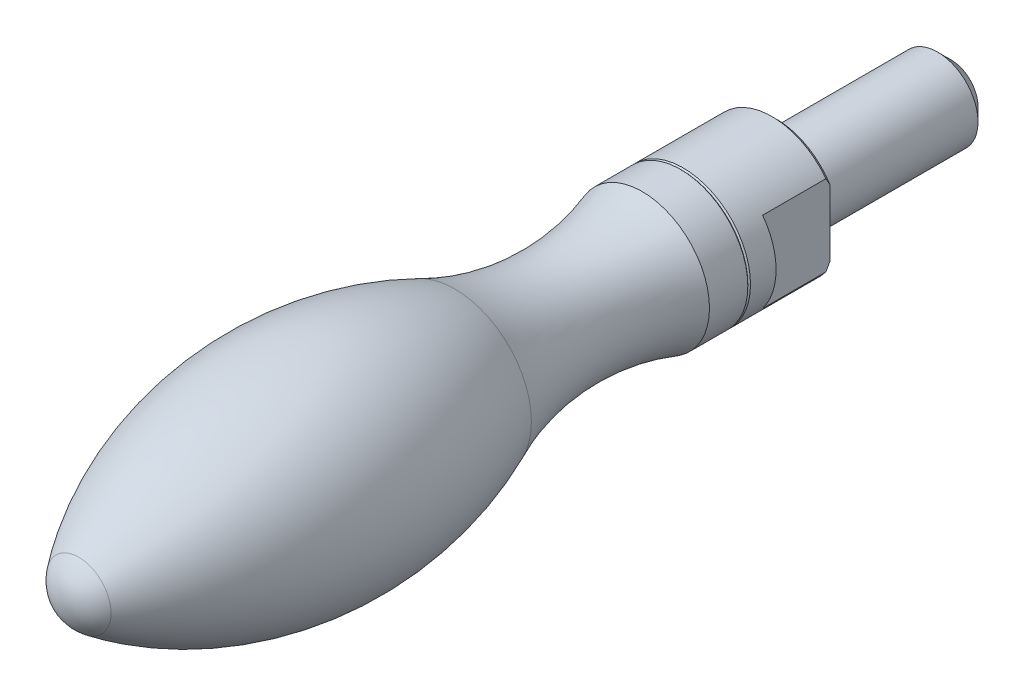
ISO-10303-21;
HEADER;
FILE_DESCRIPTION(('STEP AP214'),'2;1');
FILE_NAME('part.step','',(''),(''),'','','');
FILE_SCHEMA(('AUTOMOTIVE_DESIGN { 1 0 10303 214 1 1 1 1 }'));
ENDSEC;
DATA;
#1=APPLICATION_CONTEXT('core data for automotive mechanical design processes');
#2=APPLICATION_PROTOCOL_DEFINITION('international standard','automotive_design',2000,#1);
#3=PRODUCT_CONTEXT('',#1,'mechanical');
#4=PRODUCT('Part','Part','',(#3));
#5=PRODUCT_RELATED_PRODUCT_CATEGORY('part','',(#4));
#6=PRODUCT_DEFINITION_FORMATION('','',#4);
#7=PRODUCT_DEFINITION_CONTEXT('part definition',#1,'design');
#8=PRODUCT_DEFINITION('design','',#6,#7);
#9=PRODUCT_DEFINITION_SHAPE('','',#8);
#10=(LENGTH_UNIT() NAMED_UNIT(*) SI_UNIT(.MILLI.,.METRE.));
#11=(NAMED_UNIT(*) PLANE_ANGLE_UNIT() SI_UNIT($,.RADIAN.));
#12=(NAMED_UNIT(*) SI_UNIT($,.STERADIAN.) SOLID_ANGLE_UNIT());
#13=UNCERTAINTY_MEASURE_WITH_UNIT(LENGTH_MEASURE(1.E-05),#10,'distance_accuracy_value','');
#14=(GEOMETRIC_REPRESENTATION_CONTEXT(3) GLOBAL_UNCERTAINTY_ASSIGNED_CONTEXT((#13)) GLOBAL_UNIT_ASSIGNED_CONTEXT((#10,
#11,#12)) REPRESENTATION_CONTEXT('',''));
#15=CARTESIAN_POINT('',(0.,0.,0.));
#16=DIRECTION('',(0.,0.,1.));
#17=DIRECTION('',(1.,0.,0.));
#18=AXIS2_PLACEMENT_3D('',#15,#16,#17);
#19=CARTESIAN_POINT('',(0.,0.,-15.5000000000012));
#20=DIRECTION('',(0.,0.,-1.));
#21=DIRECTION('',(1.,0.,0.));
#22=AXIS2_PLACEMENT_3D('',#19,#20,#21);
#23=CYLINDRICAL_SURFACE('',#22,5.);
#24=CARTESIAN_POINT('',(0.,0.,6.9));
#25=DIRECTION('',(0.,0.,-1.));
#26=DIRECTION('',(1.,0.,0.));
#27=AXIS2_PLACEMENT_3D('',#24,#25,#26);
#28=CIRCLE('',#27,5.);
#29=CARTESIAN_POINT('',(5.,0.,6.9));
#30=VERTEX_POINT('',#29);
#31=EDGE_CURVE('E224',#30,#30,#28,.T.);
#32=ORIENTED_EDGE('',*,*,#31,.T.);
#33=EDGE_LOOP('',(#32));
#34=FACE_BOUND('',#33,.T.);
#35=DIRECTION('',(0.,0.,-1.));
#36=VECTOR('',#35,1.);
#37=CARTESIAN_POINT('',(-4.,-3.,-15.5000000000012));
#38=LINE('',#37,#36);
#39=CARTESIAN_POINT('',(-4.,-3.,5.));
#40=VERTEX_POINT('',#39);
#41=CARTESIAN_POINT('',(-4.,-3.,0.299999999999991));
#42=VERTEX_POINT('',#41);
#43=EDGE_CURVE('E196',#40,#42,#38,.T.);
#44=ORIENTED_EDGE('',*,*,#43,.T.);
#45=CARTESIAN_POINT('',(0.,0.,0.299999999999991));
#46=DIRECTION('',(0.,0.,1.));
#47=DIRECTION('',(1.,0.,0.));
#48=AXIS2_PLACEMENT_3D('',#45,#46,#47);
#49=CIRCLE('',#48,5.);
#50=CARTESIAN_POINT('',(3.9999999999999,-3.00000000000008,0.29999999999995));
#51=VERTEX_POINT('',#50);
#52=EDGE_CURVE('E42',#42,#51,#49,.T.);
#53=ORIENTED_EDGE('',*,*,#52,.T.);
#54=DIRECTION('',(0.,0.,-1.));
#55=VECTOR('',#54,1.);
#56=CARTESIAN_POINT('',(3.9999999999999,-3.00000000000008,-15.5000000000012));
#57=LINE('',#56,#55);
#58=CARTESIAN_POINT('',(4.,-3.,5.));
#59=VERTEX_POINT('',#58);
#60=EDGE_CURVE('E77',#59,#51,#57,.T.);
#61=ORIENTED_EDGE('',*,*,#60,.F.);
#62=CARTESIAN_POINT('',(0.,0.,5.));
#63=DIRECTION('',(0.,0.,1.));
#64=DIRECTION('',(-1.,0.,0.));
#65=AXIS2_PLACEMENT_3D('',#62,#63,#64);
#66=CIRCLE('',#65,5.);
#67=CARTESIAN_POINT('',(4.,3.,5.));
#68=VERTEX_POINT('',#67);
#69=EDGE_CURVE('E81',#59,#68,#66,.T.);
#70=ORIENTED_EDGE('',*,*,#69,.T.);
#71=DIRECTION('',(0.,0.,-1.));
#72=VECTOR('',#71,1.);
#73=CARTESIAN_POINT('',(3.9999999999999,3.00000000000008,-15.5000000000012));
#74=LINE('',#73,#72);
#75=CARTESIAN_POINT('',(3.9999999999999,3.00000000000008,0.299999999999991));
#76=VERTEX_POINT('',#75);
#77=EDGE_CURVE('E71',#76,#68,#74,.F.);
#78=ORIENTED_EDGE('',*,*,#77,.F.);
#79=CARTESIAN_POINT('',(0.,0.,0.299999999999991));
#80=DIRECTION('',(0.,0.,1.));
#81=DIRECTION('',(1.,0.,0.));
#82=AXIS2_PLACEMENT_3D('',#79,#80,#81);
#83=CIRCLE('',#82,5.);
#84=CARTESIAN_POINT('',(-4.,3.,0.299999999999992));
#85=VERTEX_POINT('',#84);
#86=EDGE_CURVE('E188',#76,#85,#83,.T.);
#87=ORIENTED_EDGE('',*,*,#86,.T.);
#88=DIRECTION('',(0.,0.,-1.));
#89=VECTOR('',#88,1.);
#90=CARTESIAN_POINT('',(-4.,3.,-15.5000000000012));
#91=LINE('',#90,#89);
#92=CARTESIAN_POINT('',(-4.,3.,5.));
#93=VERTEX_POINT('',#92);
#94=EDGE_CURVE('E201',#85,#93,#91,.F.);
#95=ORIENTED_EDGE('',*,*,#94,.T.);
#96=CARTESIAN_POINT('',(0.,0.,5.));
#97=DIRECTION('',(0.,0.,-1.));
#98=DIRECTION('',(0.,-1.,0.));
#99=AXIS2_PLACEMENT_3D('',#96,#97,#98);
#100=CIRCLE('',#99,5.);
#101=EDGE_CURVE('E89',#40,#93,#100,.T.);
#102=ORIENTED_EDGE('',*,*,#101,.F.);
#103=EDGE_LOOP('',(#44,#53,#61,#70,#78,#87,#95,#102));
#104=FACE_BOUND('',#103,.T.);
#105=ADVANCED_FACE('F14',(#34,#104),#23,.T.);
#106=CARTESIAN_POINT('',(-5.,0.,0.));
#107=DIRECTION('',(0.,0.,1.));
#108=DIRECTION('',(-1.,0.,0.));
#109=AXIS2_PLACEMENT_3D('',#106,#107,#108);
#110=PLANE('',#109);
#111=CARTESIAN_POINT('',(0.,0.,0.));
#112=DIRECTION('',(0.,0.,-1.));
#113=DIRECTION('',(1.,0.,0.));
#114=AXIS2_PLACEMENT_3D('',#111,#112,#113);
#115=CIRCLE('',#114,3.);
#116=CARTESIAN_POINT('',(3.,0.,0.));
#117=VERTEX_POINT('',#116);
#118=EDGE_CURVE('E221',#117,#117,#115,.T.);
#119=ORIENTED_EDGE('',*,*,#118,.F.);
#120=EDGE_LOOP('',(#119));
#121=FACE_BOUND('',#120,.T.);
#122=DIRECTION('',(0.,1.,0.));
#123=VECTOR('',#122,1.);
#124=CARTESIAN_POINT('',(4.,0.,0.));
#125=LINE('',#124,#123);
#126=CARTESIAN_POINT('',(4.,-2.46779253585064,0.));
#127=VERTEX_POINT('',#126);
#128=CARTESIAN_POINT('',(4.,2.46779253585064,0.));
#129=VERTEX_POINT('',#128);
#130=EDGE_CURVE('E84',#127,#129,#125,.T.);
#131=ORIENTED_EDGE('',*,*,#130,.F.);
#132=CARTESIAN_POINT('',(0.,0.,0.));
#133=DIRECTION('',(0.,0.,1.));
#134=DIRECTION('',(1.,0.,0.));
#135=AXIS2_PLACEMENT_3D('',#132,#133,#134);
#136=CIRCLE('',#135,4.7);
#137=CARTESIAN_POINT('',(-4.,-2.46779253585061,0.));
#138=VERTEX_POINT('',#137);
#139=EDGE_CURVE('E98',#127,#138,#136,.F.);
#140=ORIENTED_EDGE('',*,*,#139,.T.);
#141=DIRECTION('',(0.,1.,0.));
#142=VECTOR('',#141,1.);
#143=CARTESIAN_POINT('',(-4.,0.,0.));
#144=LINE('',#143,#142);
#145=CARTESIAN_POINT('',(-4.,2.46779253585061,0.));
#146=VERTEX_POINT('',#145);
#147=EDGE_CURVE('E186',#138,#146,#144,.T.);
#148=ORIENTED_EDGE('',*,*,#147,.T.);
#149=CARTESIAN_POINT('',(0.,0.,0.));
#150=DIRECTION('',(0.,0.,1.));
#151=DIRECTION('',(1.,0.,0.));
#152=AXIS2_PLACEMENT_3D('',#149,#150,#151);
#153=CIRCLE('',#152,4.7);
#154=EDGE_CURVE('E95',#146,#129,#153,.F.);
#155=ORIENTED_EDGE('',*,*,#154,.T.);
#156=EDGE_LOOP('',(#131,#140,#148,#155));
#157=FACE_BOUND('',#156,.T.);
#158=ADVANCED_FACE('F155',(#121,#157),#110,.F.);
#159=CARTESIAN_POINT('',(0.,0.,7.));
#160=DIRECTION('',(0.,0.,-1.));
#161=DIRECTION('',(1.,0.,0.));
#162=AXIS2_PLACEMENT_3D('',#159,#160,#161);
#163=CONICAL_SURFACE('',#162,4.9,0.785398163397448);
#164=ORIENTED_EDGE('',*,*,#31,.F.);
#165=EDGE_LOOP('',(#164));
#166=FACE_BOUND('',#165,.T.);
#167=CARTESIAN_POINT('',(0.,0.,7.));
#168=DIRECTION('',(0.,0.,-1.));
#169=DIRECTION('',(1.,0.,0.));
#170=AXIS2_PLACEMENT_3D('',#167,#168,#169);
#171=CIRCLE('',#170,4.9);
#172=CARTESIAN_POINT('',(4.9,0.,7.));
#173=VERTEX_POINT('',#172);
#174=EDGE_CURVE('E200',#173,#173,#171,.T.);
#175=ORIENTED_EDGE('',*,*,#174,.T.);
#176=EDGE_LOOP('',(#175));
#177=FACE_BOUND('',#176,.T.);
#178=ADVANCED_FACE('F153',(#166,#177),#163,.T.);
#179=CARTESIAN_POINT('',(0.,0.,-15.5000000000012));
#180=DIRECTION('',(0.,0.,-1.));
#181=DIRECTION('',(1.,0.,0.));
#182=AXIS2_PLACEMENT_3D('',#179,#180,#181);
#183=CYLINDRICAL_SURFACE('',#182,3.);
#184=CARTESIAN_POINT('',(0.,0.,-12.0000000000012));
#185=DIRECTION('',(0.,0.,1.));
#186=DIRECTION('',(1.,0.,0.));
#187=AXIS2_PLACEMENT_3D('',#184,#185,#186);
#188=CIRCLE('',#187,3.);
#189=CARTESIAN_POINT('',(3.,0.,-12.0000000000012));
#190=VERTEX_POINT('',#189);
#191=EDGE_CURVE('E87',#190,#190,#188,.T.);
#192=ORIENTED_EDGE('',*,*,#191,.T.);
#193=EDGE_LOOP('',(#192));
#194=FACE_BOUND('',#193,.T.);
#195=ORIENTED_EDGE('',*,*,#118,.T.);
#196=EDGE_LOOP('',(#195));
#197=FACE_BOUND('',#196,.T.);
#198=ADVANCED_FACE('F149',(#194,#197),#183,.T.);
#199=CARTESIAN_POINT('',(-3.,0.,-13.0000000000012));
#200=DIRECTION('',(0.,0.,1.));
#201=DIRECTION('',(-1.,0.,0.));
#202=AXIS2_PLACEMENT_3D('',#199,#200,#201);
#203=PLANE('',#202);
#204=CARTESIAN_POINT('',(0.,0.,-13.0000000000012));
#205=DIRECTION('',(0.,0.,1.));
#206=DIRECTION('',(1.,0.,0.));
#207=AXIS2_PLACEMENT_3D('',#204,#205,#206);
#208=CIRCLE('',#207,2.);
#209=CARTESIAN_POINT('',(2.,0.,-13.0000000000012));
#210=VERTEX_POINT('',#209);
#211=EDGE_CURVE('E83',#210,#210,#208,.F.);
#212=ORIENTED_EDGE('',*,*,#211,.T.);
#213=EDGE_LOOP('',(#212));
#214=FACE_BOUND('',#213,.T.);
#215=ADVANCED_FACE('F145',(#214),#203,.F.);
#216=CARTESIAN_POINT('',(0.,0.,49.9999999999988));
#217=DIRECTION('',(0.,-1.,0.));
#218=DIRECTION('',(0.,0.,1.));
#219=AXIS2_PLACEMENT_3D('',#216,#217,#218);
#220=SPHERICAL_SURFACE('',#219,3.);
#221=CARTESIAN_POINT('',(0.,0.,49.9999999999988));
#222=DIRECTION('',(0.,0.,-1.));
#223=DIRECTION('',(1.,0.,0.));
#224=AXIS2_PLACEMENT_3D('',#221,#222,#223);
#225=SPHERICAL_SURFACE('',#224,3.);
#226=CARTESIAN_POINT('',(0.,0.,51.7999999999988));
#227=DIRECTION('',(0.,0.,-1.));
#228=DIRECTION('',(1.,0.,0.));
#229=AXIS2_PLACEMENT_3D('',#226,#227,#228);
#230=CIRCLE('',#229,2.40000000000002);
#231=CARTESIAN_POINT('',(2.40000000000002,0.,51.7999999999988));
#232=VERTEX_POINT('',#231);
#233=EDGE_CURVE('E218',#232,#232,#230,.T.);
#234=ORIENTED_EDGE('',*,*,#233,.F.);
#235=EDGE_LOOP('',(#234));
#236=FACE_BOUND('',#235,.T.);
#237=ADVANCED_FACE('F141',(#236),#225,.T.);
#238=CARTESIAN_POINT('',(0.,0.,34.9999999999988));
#239=DIRECTION('',(0.,0.,-1.));
#240=DIRECTION('',(1.,0.,0.));
#241=AXIS2_PLACEMENT_3D('',#238,#239,#240);
#242=DEGENERATE_TOROIDAL_SURFACE('',#241,20.,28.,.F.);
#243=CARTESIAN_POINT('',(0.,0.,23.8660667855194));
#244=DIRECTION('',(0.,0.,-1.));
#245=DIRECTION('',(1.,0.,0.));
#246=AXIS2_PLACEMENT_3D('',#243,#244,#245);
#247=CIRCLE('',#246,5.69115667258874);
#248=CARTESIAN_POINT('',(5.69115667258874,0.,23.8660667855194));
#249=VERTEX_POINT('',#248);
#250=EDGE_CURVE('E215',#249,#249,#247,.T.);
#251=ORIENTED_EDGE('',*,*,#250,.F.);
#252=EDGE_LOOP('',(#251));
#253=FACE_BOUND('',#252,.T.);
#254=ORIENTED_EDGE('',*,*,#233,.T.);
#255=EDGE_LOOP('',(#254));
#256=FACE_BOUND('',#255,.T.);
#257=ADVANCED_FACE('F137',(#253,#256),#242,.F.);
#258=CARTESIAN_POINT('',(0.,0.,16.03));
#259=DIRECTION('',(0.,0.,-1.));
#260=DIRECTION('',(1.,0.,0.));
#261=AXIS2_PLACEMENT_3D('',#258,#259,#260);
#262=TOROIDAL_SURFACE('',#261,23.,18.9999999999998);
#263=ORIENTED_EDGE('',*,*,#250,.T.);
#264=EDGE_LOOP('',(#263));
#265=FACE_BOUND('',#264,.T.);
#266=CARTESIAN_POINT('',(0.,0.,9.9472374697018));
#267=DIRECTION('',(0.,0.,-1.));
#268=DIRECTION('',(1.,0.,0.));
#269=AXIS2_PLACEMENT_3D('',#266,#267,#268);
#270=CIRCLE('',#269,5.);
#271=CARTESIAN_POINT('',(5.,0.,9.9472374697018));
#272=VERTEX_POINT('',#271);
#273=EDGE_CURVE('E212',#272,#272,#270,.T.);
#274=ORIENTED_EDGE('',*,*,#273,.F.);
#275=EDGE_LOOP('',(#274));
#276=FACE_BOUND('',#275,.T.);
#277=ADVANCED_FACE('F133',(#265,#276),#262,.F.);
#278=CARTESIAN_POINT('',(0.,0.,-15.5000000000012));
#279=DIRECTION('',(0.,0.,-1.));
#280=DIRECTION('',(1.,0.,0.));
#281=AXIS2_PLACEMENT_3D('',#278,#279,#280);
#282=CYLINDRICAL_SURFACE('',#281,5.);
#283=ORIENTED_EDGE('',*,*,#273,.T.);
#284=EDGE_LOOP('',(#283));
#285=FACE_BOUND('',#284,.T.);
#286=CARTESIAN_POINT('',(0.,0.,7.1));
#287=DIRECTION('',(0.,0.,-1.));
#288=DIRECTION('',(1.,0.,0.));
#289=AXIS2_PLACEMENT_3D('',#286,#287,#288);
#290=CIRCLE('',#289,5.);
#291=CARTESIAN_POINT('',(5.,0.,7.1));
#292=VERTEX_POINT('',#291);
#293=EDGE_CURVE('E204',#292,#292,#290,.T.);
#294=ORIENTED_EDGE('',*,*,#293,.F.);
#295=EDGE_LOOP('',(#294));
#296=FACE_BOUND('',#295,.T.);
#297=ADVANCED_FACE('F129',(#285,#296),#282,.T.);
#298=CARTESIAN_POINT('',(0.,0.,7.1));
#299=DIRECTION('',(0.,0.,1.));
#300=DIRECTION('',(-1.,0.,0.));
#301=AXIS2_PLACEMENT_3D('',#298,#299,#300);
#302=CONICAL_SURFACE('',#301,5.,0.785398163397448);
#303=ORIENTED_EDGE('',*,*,#174,.F.);
#304=EDGE_LOOP('',(#303));
#305=FACE_BOUND('',#304,.T.);
#306=ORIENTED_EDGE('',*,*,#293,.T.);
#307=EDGE_LOOP('',(#306));
#308=FACE_BOUND('',#307,.T.);
#309=ADVANCED_FACE('F125',(#305,#308),#302,.T.);
#310=CARTESIAN_POINT('',(-7.5246006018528,5.,5.));
#311=DIRECTION('',(0.,0.,-1.));
#312=DIRECTION('',(0.,-1.,0.));
#313=AXIS2_PLACEMENT_3D('',#310,#311,#312);
#314=PLANE('',#313);
#315=ORIENTED_EDGE('',*,*,#101,.T.);
#316=DIRECTION('',(0.,-1.,0.));
#317=VECTOR('',#316,1.);
#318=CARTESIAN_POINT('',(-4.,5.,5.));
#319=LINE('',#318,#317);
#320=EDGE_CURVE('E206',#93,#40,#319,.T.);
#321=ORIENTED_EDGE('',*,*,#320,.T.);
#322=EDGE_LOOP('',(#315,#321));
#323=FACE_BOUND('',#322,.T.);
#324=ADVANCED_FACE('F118',(#323),#314,.T.);
#325=CARTESIAN_POINT('',(-4.,5.,-1.9624240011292));
#326=DIRECTION('',(1.,0.,0.));
#327=DIRECTION('',(0.,1.,0.));
#328=AXIS2_PLACEMENT_3D('',#325,#326,#327);
#329=PLANE('',#328);
#330=ORIENTED_EDGE('',*,*,#147,.F.);
#331=CARTESIAN_POINT('',(-4.,-2.46779253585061,0.));
#332=CARTESIAN_POINT('',(-4.,-2.51287954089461,0.0236742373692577));
#333=CARTESIAN_POINT('',(-4.,-2.55777296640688,0.0477152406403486));
#334=CARTESIAN_POINT('',(-4.,-2.6471796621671,0.0964731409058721));
#335=CARTESIAN_POINT('',(-4.,-2.69169300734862,0.12118990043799));
#336=CARTESIAN_POINT('',(-4.,-2.78036387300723,0.171250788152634));
#337=CARTESIAN_POINT('',(-4.,-2.82452140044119,0.196594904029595));
#338=CARTESIAN_POINT('',(-4.,-2.91250648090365,0.247869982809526));
#339=CARTESIAN_POINT('',(-4.,-2.95633396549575,0.273801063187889));
#340=CARTESIAN_POINT('',(-4.,-3.00000000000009,0.299999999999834));
#341=B_SPLINE_CURVE_WITH_KNOTS('',3,(#331,#332,#333,#334,#335,#336,#337,#338,#339,#340),
.UNSPECIFIED.,.F.,.F.,(4,2,2,2,4),(0.,0.152770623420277,0.305510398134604,0.458247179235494,
0.611014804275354),.UNSPECIFIED.);
#342=EDGE_CURVE('E108',#138,#42,#341,.T.);
#343=ORIENTED_EDGE('',*,*,#342,.T.);
#344=ORIENTED_EDGE('',*,*,#43,.F.);
#345=ORIENTED_EDGE('',*,*,#320,.F.);
#346=ORIENTED_EDGE('',*,*,#94,.F.);
#347=CARTESIAN_POINT('',(-4.,3.,0.299999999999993));
#348=CARTESIAN_POINT('',(-4.,2.95633396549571,0.273801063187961));
#349=CARTESIAN_POINT('',(-4.,2.91250648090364,0.247869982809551));
#350=CARTESIAN_POINT('',(-4.,2.82452140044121,0.196594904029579));
#351=CARTESIAN_POINT('',(-4.,2.78036387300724,0.171250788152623));
#352=CARTESIAN_POINT('',(-4.,2.69169300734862,0.121189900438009));
#353=CARTESIAN_POINT('',(-4.,2.64717966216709,0.096473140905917));
#354=CARTESIAN_POINT('',(-4.,2.55777296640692,0.0477152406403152));
#355=CARTESIAN_POINT('',(-4.,2.51287954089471,0.0236742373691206));
#356=CARTESIAN_POINT('',(-4.,2.46779253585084,-3.80434186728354E-13));
#357=B_SPLINE_CURVE_WITH_KNOTS('',3,(#347,#348,#349,#350,#351,#352,#353,#354,#355,#356),
.UNSPECIFIED.,.F.,.F.,(4,2,2,2,4),(0.,0.15276762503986,0.305504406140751,0.458244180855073,
0.611014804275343),.UNSPECIFIED.);
#358=EDGE_CURVE('E101',#85,#146,#357,.T.);
#359=ORIENTED_EDGE('',*,*,#358,.T.);
#360=EDGE_LOOP('',(#330,#343,#344,#345,#346,#359));
#361=FACE_BOUND('',#360,.T.);
#362=ADVANCED_FACE('F114',(#361),#329,.F.);
#363=CARTESIAN_POINT('',(7.52460060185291,5.,5.));
#364=DIRECTION('',(0.,0.,1.));
#365=DIRECTION('',(-1.,0.,0.));
#366=AXIS2_PLACEMENT_3D('',#363,#364,#365);
#367=PLANE('',#366);
#368=DIRECTION('',(0.,-1.,0.));
#369=VECTOR('',#368,1.);
#370=CARTESIAN_POINT('',(4.,5.,5.));
#371=LINE('',#370,#369);
#372=EDGE_CURVE('E74',#68,#59,#371,.T.);
#373=ORIENTED_EDGE('',*,*,#372,.F.);
#374=ORIENTED_EDGE('',*,*,#69,.F.);
#375=EDGE_LOOP('',(#373,#374));
#376=FACE_BOUND('',#375,.T.);
#377=ADVANCED_FACE('F80',(#376),#367,.F.);
#378=CARTESIAN_POINT('',(4.,5.,-1.9624240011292));
#379=DIRECTION('',(1.,0.,0.));
#380=DIRECTION('',(0.,0.,1.));
#381=AXIS2_PLACEMENT_3D('',#378,#379,#380);
#382=PLANE('',#381);
#383=ORIENTED_EDGE('',*,*,#60,.T.);
#384=CARTESIAN_POINT('',(3.99999999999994,-3.0000000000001,0.299999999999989));
#385=CARTESIAN_POINT('',(3.99999999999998,-2.95633396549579,0.273801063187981));
#386=CARTESIAN_POINT('',(4.,-2.91250648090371,0.24786998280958));
#387=CARTESIAN_POINT('',(4.00000000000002,-2.82452140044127,0.19659490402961));
#388=CARTESIAN_POINT('',(4.00000000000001,-2.7803638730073,0.171250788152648));
#389=CARTESIAN_POINT('',(4.00000000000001,-2.69169300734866,0.121189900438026));
#390=CARTESIAN_POINT('',(4.00000000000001,-2.64717966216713,0.0964731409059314));
#391=CARTESIAN_POINT('',(4.00000000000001,-2.55777296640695,0.0477152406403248));
#392=CARTESIAN_POINT('',(4.00000000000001,-2.51287954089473,0.0236742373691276));
#393=CARTESIAN_POINT('',(4.,-2.46779253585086,-3.78324554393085E-13));
#394=B_SPLINE_CURVE_WITH_KNOTS('',3,(#384,#385,#386,#387,#388,#389,#390,#391,#392,#393),
.UNSPECIFIED.,.F.,.F.,(4,2,2,2,4),(0.,0.152767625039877,0.305504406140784,0.458244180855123,
0.611014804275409),.UNSPECIFIED.);
#395=EDGE_CURVE('E9',#51,#127,#394,.T.);
#396=ORIENTED_EDGE('',*,*,#395,.T.);
#397=ORIENTED_EDGE('',*,*,#130,.T.);
#398=CARTESIAN_POINT('',(4.,2.46779253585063,0.));
#399=CARTESIAN_POINT('',(4.00000000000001,2.51287954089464,0.023674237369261));
#400=CARTESIAN_POINT('',(4.00000000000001,2.55777296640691,0.0477152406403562));
#401=CARTESIAN_POINT('',(4.00000000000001,2.64717966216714,0.0964731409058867));
#402=CARTESIAN_POINT('',(4.00000000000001,2.69169300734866,0.121189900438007));
#403=CARTESIAN_POINT('',(4.00000000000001,2.78036387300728,0.171250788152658));
#404=CARTESIAN_POINT('',(4.00000000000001,2.82452140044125,0.196594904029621));
#405=CARTESIAN_POINT('',(4.00000000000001,2.91250648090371,0.247869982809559));
#406=CARTESIAN_POINT('',(4.00000000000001,2.95633396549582,0.273801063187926));
#407=CARTESIAN_POINT('',(4.,3.00000000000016,0.299999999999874));
#408=B_SPLINE_CURVE_WITH_KNOTS('',3,(#398,#399,#400,#401,#402,#403,#404,#405,#406,#407),
.UNSPECIFIED.,.F.,.F.,(4,2,2,2,4),(0.,0.152770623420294,0.305510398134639,0.458247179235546,
0.611014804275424),.UNSPECIFIED.);
#409=EDGE_CURVE('E28',#129,#76,#408,.T.);
#410=ORIENTED_EDGE('',*,*,#409,.T.);
#411=ORIENTED_EDGE('',*,*,#77,.T.);
#412=ORIENTED_EDGE('',*,*,#372,.T.);
#413=EDGE_LOOP('',(#383,#396,#397,#410,#411,#412));
#414=FACE_BOUND('',#413,.T.);
#415=ADVANCED_FACE('F73',(#414),#382,.T.);
#416=CARTESIAN_POINT('',(0.,0.,-13.0000000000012));
#417=DIRECTION('',(0.,0.,1.));
#418=DIRECTION('',(1.,0.,0.));
#419=AXIS2_PLACEMENT_3D('',#416,#417,#418);
#420=CONICAL_SURFACE('',#419,2.,0.785398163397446);
#421=ORIENTED_EDGE('',*,*,#191,.F.);
#422=EDGE_LOOP('',(#421));
#423=FACE_BOUND('',#422,.T.);
#424=ORIENTED_EDGE('',*,*,#211,.F.);
#425=EDGE_LOOP('',(#424));
#426=FACE_BOUND('',#425,.T.);
#427=ADVANCED_FACE('F165',(#423,#426),#420,.T.);
#428=CARTESIAN_POINT('',(0.,0.,0.));
#429=DIRECTION('',(0.,0.,1.));
#430=DIRECTION('',(1.,0.,0.));
#431=AXIS2_PLACEMENT_3D('',#428,#429,#430);
#432=CONICAL_SURFACE('',#431,4.7,0.785398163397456);
#433=ORIENTED_EDGE('',*,*,#395,.F.);
#434=ORIENTED_EDGE('',*,*,#52,.F.);
#435=ORIENTED_EDGE('',*,*,#342,.F.);
#436=ORIENTED_EDGE('',*,*,#139,.F.);
#437=EDGE_LOOP('',(#433,#434,#435,#436));
#438=FACE_BOUND('',#437,.T.);
#439=ADVANCED_FACE('F167',(#438),#432,.T.);
#440=CARTESIAN_POINT('',(0.,0.,0.));
#441=DIRECTION('',(0.,0.,1.));
#442=DIRECTION('',(1.,0.,0.));
#443=AXIS2_PLACEMENT_3D('',#440,#441,#442);
#444=CONICAL_SURFACE('',#443,4.7,0.785398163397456);
#445=ORIENTED_EDGE('',*,*,#358,.F.);
#446=ORIENTED_EDGE('',*,*,#86,.F.);
#447=ORIENTED_EDGE('',*,*,#409,.F.);
#448=ORIENTED_EDGE('',*,*,#154,.F.);
#449=EDGE_LOOP('',(#445,#446,#447,#448));
#450=FACE_BOUND('',#449,.T.);
#451=ADVANCED_FACE('F16',(#450),#444,.T.);
#452=CLOSED_SHELL('',(#105,#158,#178,#198,#215,#237,#257,#277,#297,#309,#324,#362,#377,#415,
#427,#439,#451));
#453=MANIFOLD_SOLID_BREP('B1',#452);
#454=ADVANCED_BREP_SHAPE_REPRESENTATION('',(#18,#453),#14);
#455=SHAPE_DEFINITION_REPRESENTATION(#9,#454);
ENDSEC;
END-ISO-10303-21;
